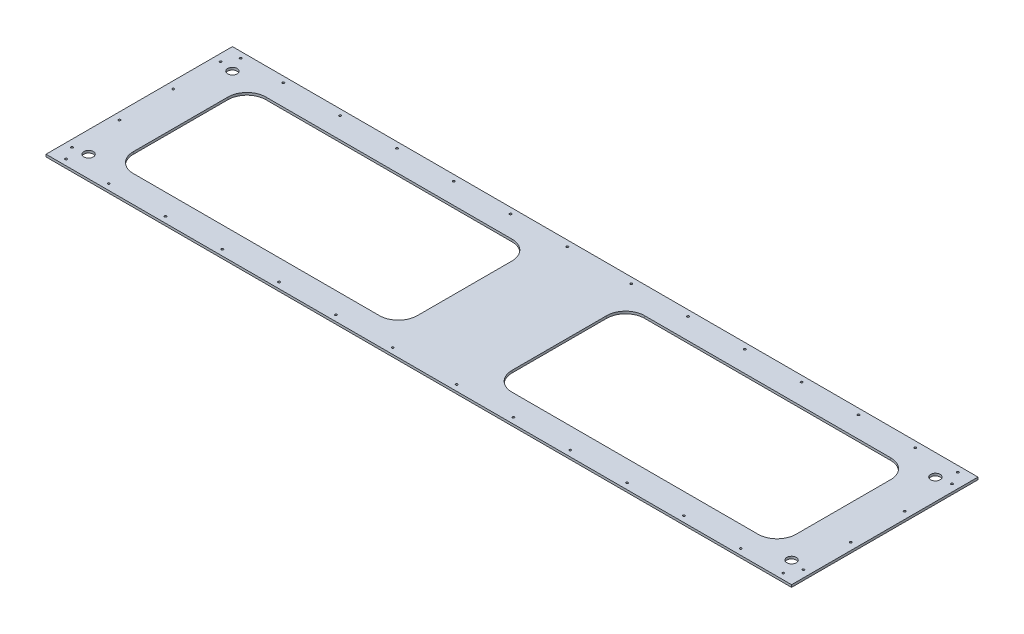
from build123d import *

# Parameters (mm, degrees)
SKETCH1_W           = 2000.25
SKETCH1_H           = 500.126
BOSS_EXTRUDE1_DEPTH = 6.35
SKETCH2_R           = 2.8067
CUT_EXTRUDE1_DEPTH  = 2062.835687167
CUT_EXTRUDE2_DEPTH  = 2062.835687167
SKETCH7_R           = 12.7
AIR_BLEEDS_DEPTH    = 2062.835687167


with BuildPart() as part:
    # Sketch1 → Boss-Extrude1 (new body)
    with BuildSketch(Plane(origin=(0, 0, 0), x_dir=(1, 0, 0), z_dir=(0, 1, 0))):
        with Locations((1000.125, 250.063)):
            Rectangle(SKETCH1_W, SKETCH1_H)
    extrude(amount=BOSS_EXTRUDE1_DEPTH)

    # Sketch2 → Cut-Extrude1 (cut, through all)
    with BuildSketch(Plane(origin=(0, 6.35, 0), x_dir=(1, 0, 0), z_dir=(0, 1, 0))):
        with Locations(Location((1962.149999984, 15.874999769, 0), (0, 0, 270))):
            Circle(SKETCH2_R)
        with Locations(Location((1847.849999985, 15.874999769, 0), (0, 0, 270))):
            Circle(SKETCH2_R)
        with Locations(Location((1981.199999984, 50.8, 0), (0, 0, 270))):
            Circle(SKETCH2_R)
        with Locations(Location((1695.449999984, 15.874999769, 0), (0, 0, 270))):
            Circle(SKETCH2_R)
        with Locations(Location((1543.049999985, 15.874999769, 0), (0, 0, 270))):
            Circle(SKETCH2_R)
        with Locations(Location((1390.649999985, 15.874999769, 0), (0, 0, 270))):
            Circle(SKETCH2_R)
        with Locations(Location((1238.249999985, 15.874999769, 0), (0, 0, 270))):
            Circle(SKETCH2_R)
        with Locations(Location((1085.849999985, 15.874999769, 0), (0, 0, 270))):
            Circle(SKETCH2_R)
        with Locations(Location((914.4, 15.874999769, 0), (0, 0, 270))):
            Circle(SKETCH2_R)
        with Locations(Location((762, 15.874999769, 0), (0, 0, 270))):
            Circle(SKETCH2_R)
        with Locations(Location((609.6, 15.874999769, 0), (0, 0, 270))):
            Circle(SKETCH2_R)
        with Locations(Location((457.2, 15.874999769, 0), (0, 0, 270))):
            Circle(SKETCH2_R)
        with Locations(Location((304.8, 15.874999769, 0), (0, 0, 270))):
            Circle(SKETCH2_R)
        with Locations(Location((152.4, 15.874999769, 0), (0, 0, 270))):
            Circle(SKETCH2_R)
        with Locations(Location((38.1, 15.874999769, 0), (0, 0, 270))):
            Circle(SKETCH2_R)
        with Locations(Location((19.05, 50.8, 0), (0, 0, 270))):
            Circle(SKETCH2_R)
        with Locations(Location((19.05, 177.799999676, 0), (0, 0, 270))):
            Circle(SKETCH2_R)
        with Locations(Location((19.05, 322.326, 0), (0, 0, 270))):
            Circle(SKETCH2_R)
        with Locations(Location((19.05, 449.326, 0), (0, 0, 270))):
            Circle(SKETCH2_R)
        with Locations(Location((38.1, 484.250999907, 0), (0, 0, 270))):
            Circle(SKETCH2_R)
        with Locations(Location((152.4, 484.250999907, 0), (0, 0, 270))):
            Circle(SKETCH2_R)
        with Locations(Location((304.8, 484.250999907, 0), (0, 0, 270))):
            Circle(SKETCH2_R)
        with Locations(Location((457.2, 484.250999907, 0), (0, 0, 270))):
            Circle(SKETCH2_R)
        with Locations(Location((609.6, 484.250999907, 0), (0, 0, 270))):
            Circle(SKETCH2_R)
        with Locations(Location((762, 484.250999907, 0), (0, 0, 270))):
            Circle(SKETCH2_R)
        with Locations(Location((914.4, 484.250999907, 0), (0, 0, 270))):
            Circle(SKETCH2_R)
        with Locations(Location((1085.849999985, 484.250999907, 0), (0, 0, 270))):
            Circle(SKETCH2_R)
        with Locations(Location((1238.249999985, 484.250999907, 0), (0, 0, 270))):
            Circle(SKETCH2_R)
        with Locations(Location((1390.649999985, 484.250999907, 0), (0, 0, 270))):
            Circle(SKETCH2_R)
        with Locations(Location((1543.049999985, 484.250999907, 0), (0, 0, 270))):
            Circle(SKETCH2_R)
        with Locations(Location((1695.449999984, 484.250999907, 0), (0, 0, 270))):
            Circle(SKETCH2_R)
        with Locations(Location((1847.849999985, 484.250999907, 0), (0, 0, 270))):
            Circle(SKETCH2_R)
        with Locations(Location((1962.149999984, 484.250999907, 0), (0, 0, 270))):
            Circle(SKETCH2_R)
        with Locations(Location((1981.199999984, 449.325999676, 0), (0, 0, 270))):
            Circle(SKETCH2_R)
        with Locations(Location((1981.199999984, 322.326, 0), (0, 0, 270))):
            Circle(SKETCH2_R)
        with Locations(Location((1981.199999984, 177.799999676, 0), (0, 0, 270))):
            Circle(SKETCH2_R)
    extrude(amount=-CUT_EXTRUDE1_DEPTH, mode=Mode.SUBTRACT)

    # Sketch3 → Cut-Extrude2 (cut, through all)
    with BuildSketch(Plane(origin=(0, 6.35, 0), x_dir=(1, 0, 0), z_dir=(0, 1, 0))):
        with BuildLine():
            Line((111.125, 377.063), (111.125, 123.063))
            ThreePointArc((111.125, 123.063), (126.003975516, 87.141975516), (161.925, 72.263))
            Line((161.925, 72.263), (822.325, 72.263))
            ThreePointArc((822.325, 72.263), (858.246024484, 87.141975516), (873.125, 123.063))
            Line((873.125, 123.063), (873.125, 377.063))
            ThreePointArc((873.125, 377.063), (858.246024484, 412.984024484), (822.325, 427.863))
            Line((822.325, 427.863), (161.925, 427.863))
            ThreePointArc((161.925, 427.863), (126.003975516, 412.984024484), (111.125, 377.063))
        make_face()
        with BuildLine():
            Line((1177.925, 427.863), (1838.325, 427.863))
            ThreePointArc((1838.325, 427.863), (1874.246024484, 412.984024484), (1889.125, 377.063))
            Line((1889.125, 377.063), (1889.125, 123.063))
            ThreePointArc((1889.125, 123.063), (1874.246024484, 87.141975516), (1838.325, 72.263))
            Line((1838.325, 72.263), (1177.925, 72.263))
            ThreePointArc((1177.925, 72.263), (1142.003975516, 87.141975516), (1127.125, 123.063))
            Line((1127.125, 123.063), (1127.125, 377.063))
            ThreePointArc((1127.125, 377.063), (1142.003975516, 412.984024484), (1177.925, 427.863))
        make_face()
    extrude(amount=-CUT_EXTRUDE2_DEPTH, mode=Mode.SUBTRACT)

    # Sketch7 → air bleeds (cut, through all)
    with BuildSketch(Plane(origin=(0, 6.35, 0), x_dir=(1, 0, 0), z_dir=(0, 1, 0))):
        with Locations(Location((57.15, 442.976, 0), (0, 0, 270))):
            Circle(SKETCH7_R)
        with Locations(Location((57.15, 57.15, 0), (0, 0, 270))):
            Circle(SKETCH7_R)
        with Locations(Location((1943.1, 57.15, 0), (0, 0, 90))):
            Circle(SKETCH7_R)
        with Locations(Location((1943.1, 442.976, 0), (0, 0, 90))):
            Circle(SKETCH7_R)
    extrude(amount=-AIR_BLEEDS_DEPTH, mode=Mode.SUBTRACT)


solid = part.part
